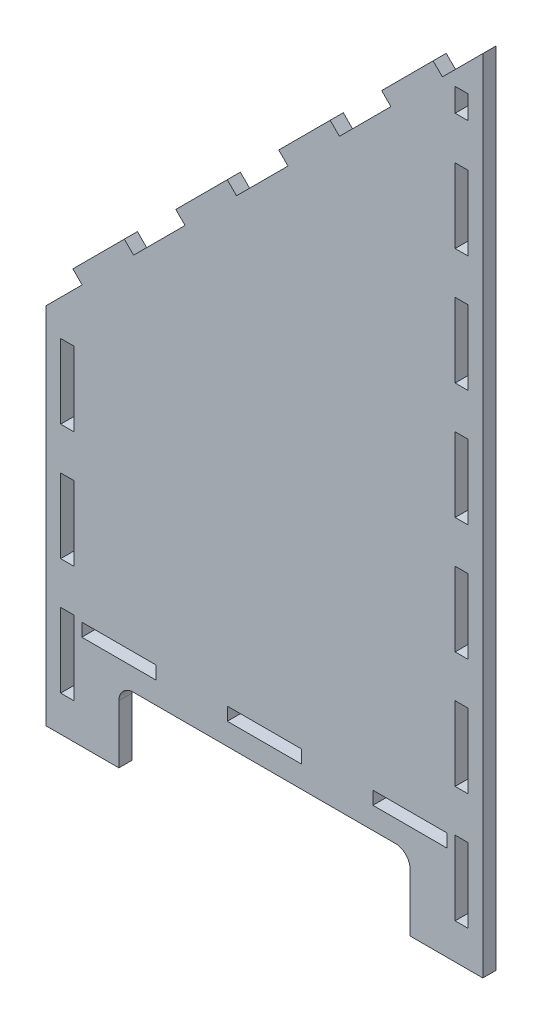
from build123d import *

# Parameters (mm, degrees)
BOSS_EXTRUDE1_DEPTH = 9
SKETCH2_W           = 51
SKETCH2_H           = 9
CUT_EXTRUDE2_DEPTH  = 584.164642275
SKETCH4_W           = 9
SKETCH4_H           = 51
CUT_EXTRUDE4_DEPTH  = 584.164642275
SKETCH5_W           = 9
SKETCH5_H           = 51
CUT_EXTRUDE5_DEPTH  = 584.164642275
LPATTERN6_COUNT     = 3
LPATTERN6_PITCH     = 100
LPATTERN7_COUNT     = 3
LPATTERN7_PITCH     = 80
LPATTERN8_COUNT     = 6
LPATTERN8_PITCH     = 80
SKETCH7_W           = 9
SKETCH7_H           = 16
CUT_EXTRUDE6_DEPTH  = 584.164642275


with BuildPart() as part:
    # Sketch1 → Boss-Extrude1 (new body)
    with BuildSketch(Plane.XY):
        with BuildLine():
            Line((60, 0), (240, 0))
            ThreePointArc((240, 0), (247.071067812, -2.928932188), (250, -10))
            Line((250, -10), (250, -50))
            Line((250, -50), (300, -50))
            Line((300, -50), (300, 0))
            Line((300, 0), (300, 500))
            Line((300, 500), (272.236110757, 472.236110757))
            Line((272.236110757, 472.236110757), (265.872149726, 478.600071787))
            Line((265.872149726, 478.600071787), (230.516810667, 443.244732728))
            Line((230.516810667, 443.244732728), (236.880771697, 436.880771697))
            Line((236.880771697, 436.880771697), (201.525432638, 401.525432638))
            Line((201.525432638, 401.525432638), (195.161471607, 407.889393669))
            Line((195.161471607, 407.889393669), (159.806132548, 372.53405461))
            Line((159.806132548, 372.53405461), (166.170093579, 366.170093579))
            Line((166.170093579, 366.170093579), (130.81475452, 330.81475452))
            Line((130.81475452, 330.81475452), (124.450793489, 337.17871555))
            Line((124.450793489, 337.17871555), (89.09545443, 301.823376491))
            Line((89.09545443, 301.823376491), (95.45941546, 295.45941546))
            Line((95.45941546, 295.45941546), (60.104076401, 260.104076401))
            Line((60.104076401, 260.104076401), (53.74011537, 266.468037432))
            Line((53.74011537, 266.468037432), (18.384776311, 231.112698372))
            Line((18.384776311, 231.112698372), (24.748737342, 224.748737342))
            Line((24.748737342, 224.748737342), (0, 200))
            Line((0, 200), (0, 0))
            Line((0, 0), (0, -50))
            Line((0, -50), (50, -50))
            Line((50, -50), (50, -10))
            ThreePointArc((50, -10), (52.928932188, -2.928932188), (60, 0))
        make_face()
    extrude(amount=BOSS_EXTRUDE1_DEPTH)

    # Sketch2 → Cut-Extrude2 (cut, through all)
    with BuildSketch(Plane.XY):
        with Locations((50, 19.5)):
            Rectangle(SKETCH2_W, SKETCH2_H)
    cut_extrude2 = extrude(amount=CUT_EXTRUDE2_DEPTH, mode=Mode.SUBTRACT)

    # Sketch4 → Cut-Extrude4 (cut, through all)
    with BuildSketch(Plane.XY.offset(9)):
        with Locations((14.5, 0)):
            Rectangle(SKETCH4_W, SKETCH4_H)
    cut_extrude4 = extrude(amount=-CUT_EXTRUDE4_DEPTH, mode=Mode.SUBTRACT)

    # Sketch5 → Cut-Extrude5 (cut, through all)
    with BuildSketch(Plane.XY.offset(9)):
        with Locations((285.5, 0)):
            Rectangle(SKETCH5_W, SKETCH5_H)
    cut_extrude5 = extrude(amount=-CUT_EXTRUDE5_DEPTH, mode=Mode.SUBTRACT)

    # LPattern6: Cut-Extrude2 ×3
    with Locations(*[(i * LPATTERN6_PITCH, 0, 0) for i in range(1, LPATTERN6_COUNT)]):
        add(cut_extrude2, mode=Mode.SUBTRACT)

    # LPattern7: Cut-Extrude4 ×3
    with Locations(*[(0, i * LPATTERN7_PITCH, 0) for i in range(1, LPATTERN7_COUNT)]):
        add(cut_extrude4, mode=Mode.SUBTRACT)

    # LPattern8: Cut-Extrude5 ×6
    with Locations(*[(0, i * LPATTERN8_PITCH, 0) for i in range(1, LPATTERN8_COUNT)]):
        add(cut_extrude5, mode=Mode.SUBTRACT)

    # Sketch7 → Cut-Extrude6 (cut, through all)
    with BuildSketch(Plane.XY.offset(9)):
        with Locations((285.5, 463)):
            Rectangle(SKETCH7_W, SKETCH7_H)
    extrude(amount=-CUT_EXTRUDE6_DEPTH, mode=Mode.SUBTRACT)


solid = part.part
